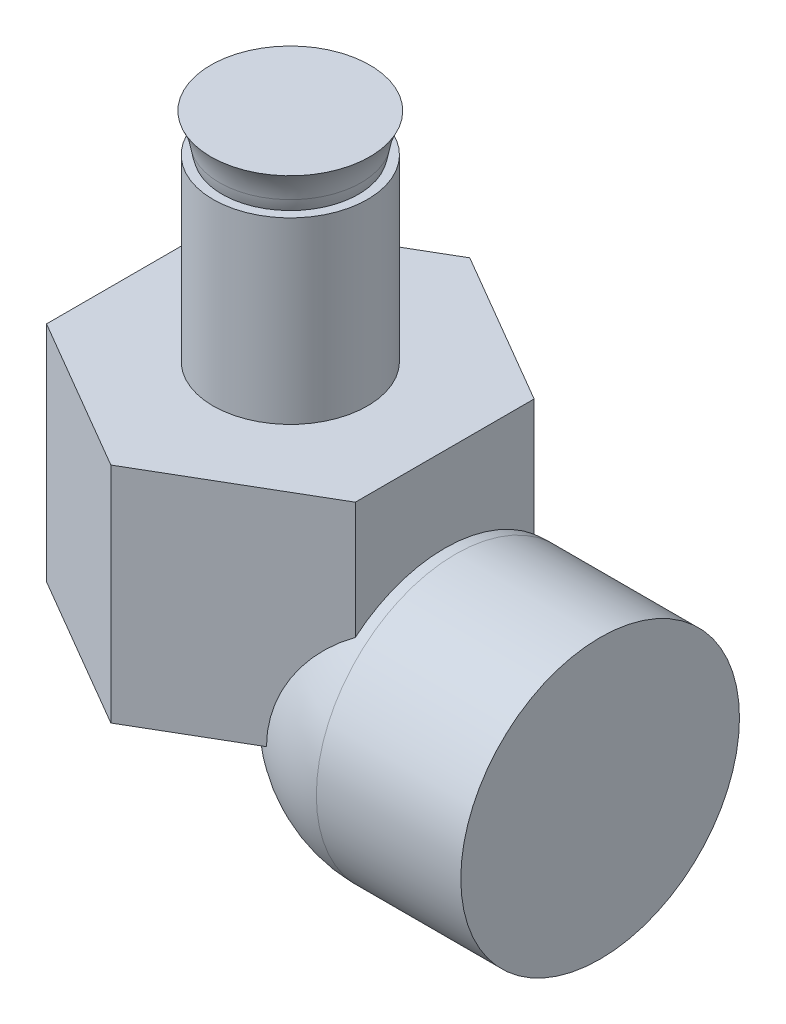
from build123d import *

# Parameters (mm, degrees)
EXTRUDE_1_DEPTH = 50


with BuildPart() as part:
    # Sketch 1 → Extrude 1 (new body)
    with BuildSketch(Plane(origin=(0, 0, 0), x_dir=(1, 0, 0), z_dir=(0, 1, 0))):
        Polygon((0, 40.154301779), (-34.551470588, 20), (-34.551470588, -20), (0, -40.154301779), (34.551470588, -20), (34.551470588, 20), align=None)
    extrude(amount=EXTRUDE_1_DEPTH)

    # Sketch 2 → Revolve 1 (revolve)
    with BuildSketch(Plane(origin=(0, 0, 0), x_dir=(1, 0, 0), z_dir=(0, 1, 0))):
        with BuildLine():
            Line((37, 31.178817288), (69.327075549, 31.178817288))
            Line((69.327075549, 31.178817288), (69.327075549, 0))
            Line((69.327075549, 0), (5.821182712, 0))
            ThreePointArc((5.821182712, 0), (14.953246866, 22.046753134), (37, 31.178817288))
        make_face()
    revolve(axis=Axis((-29.667216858, 0, 0), (1, 0, 0)))

    # Sketch 3 → Revolve 3 (revolve)
    with BuildSketch(Plane.XY, mode=Mode.PRIVATE) as revolve_3_sk:
        with BuildLine():
            Line((-17.275735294, 50), (-17.275735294, 90.023752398))
            Line((-17.275735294, 90.023752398), (-15.273773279, 90.023752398))
            ThreePointArc((-15.273773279, 90.023752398), (-15.608168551, 91.271763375), (-15.840767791, 92.542687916))
            ThreePointArc((-15.840767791, 92.542687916), (-16.554972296, 95.628703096), (-17.79152455, 98.544953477))
            Line((-17.79152455, 98.544953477), (0, 98.544953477))
            Line((0, 98.544953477), (0, 50))
            Line((0, 50), (-17.275735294, 50))
        make_face()
    revolve(revolve_3_sk.sketch.rotate(Axis((0, 131.495262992, 0), (0, -1, 0)), 270), axis=Axis((0, 131.495262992, 0), (0, -1, 0)))


solid = part.part
